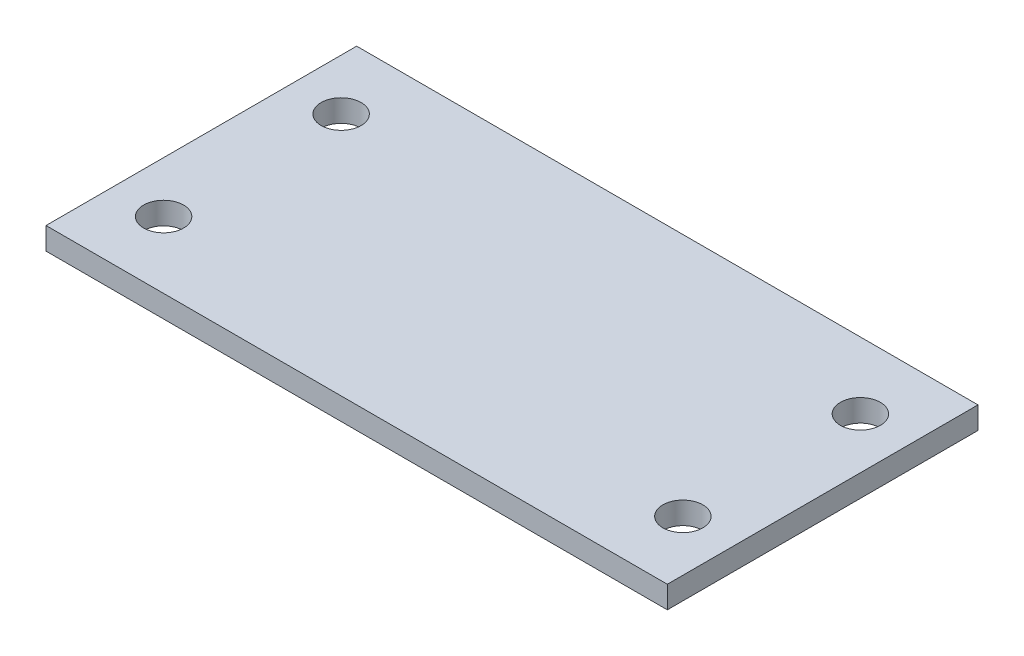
from build123d import *

# Parameters (mm, degrees)
SKETCH1_W            = 70
SKETCH1_H            = 35
BOSS_EXTRUDE1_DEPTH  = 2.5
SKETCH2_R            = 2.25
CUT_EXTRUDE1_DEPTH   = 79.302298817
LPATTERN1_COUNT      = 2
LPATTERN1_PITCH      = 58.5
LPATTERN1_COUNT_DIR2 = 2
LPATTERN1_PITCH_DIR2 = 20


with BuildPart() as part:
    # Sketch1 → Boss-Extrude1 (new body)
    with BuildSketch(Plane(origin=(0, 0, 0), x_dir=(1, 0, 0), z_dir=(0, 1, 0))):
        with Locations((35, 17.5)):
            Rectangle(SKETCH1_W, SKETCH1_H)
    extrude(amount=BOSS_EXTRUDE1_DEPTH)

    # Sketch2 → Cut-Extrude1 (cut, through all)
    with BuildSketch(Plane(origin=(0, 2.5, 0), x_dir=(1, 0, 0), z_dir=(0, 1, 0))):
        with Locations(Location((5.75, 27.5, 0), (0, 0, 270))):
            Circle(SKETCH2_R)
    cut_extrude1 = extrude(amount=-CUT_EXTRUDE1_DEPTH, mode=Mode.SUBTRACT)

    # LPattern1: Cut-Extrude1 2 × 2
    with Locations(*[(i * LPATTERN1_PITCH, 0, j * LPATTERN1_PITCH_DIR2) for i in range(LPATTERN1_COUNT) for j in range(LPATTERN1_COUNT_DIR2) if (i, j) != (0, 0)]):
        add(cut_extrude1, mode=Mode.SUBTRACT)


solid = part.part
